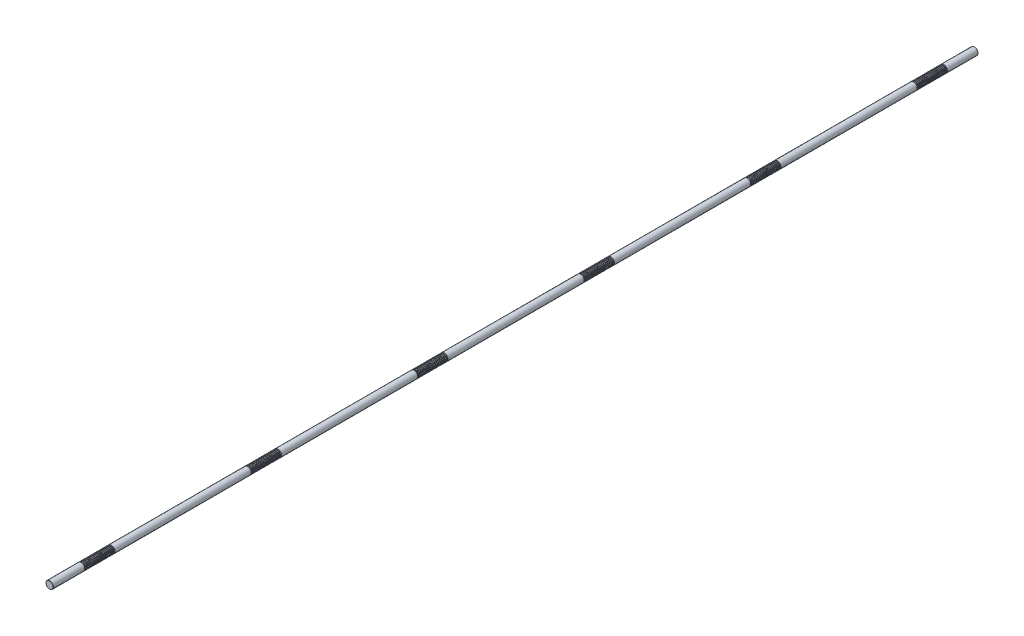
from build123d import *

# Parameters (mm, degrees)
SKETCH1_R           = 12
BOSS_EXTRUDE1_DEPTH = 1500
CHAMFER1_SIZE       = 0.6
LPATTERN1_COUNT     = 20
LPATTERN1_PITCH     = 5
LPATTERN2_COUNT     = 6
LPATTERN2_PITCH     = 540


with BuildPart() as part:
    # Sketch1 → Boss-Extrude1 (new, symmetric)
    with BuildSketch(Plane.XY):
        Circle(SKETCH1_R)
    extrude(amount=BOSS_EXTRUDE1_DEPTH, both=True)

    # Chamfer1
    chamfer1_edges = [part.edges().sort_by_distance(p)[0] for p in [
        (-12, 0, -1500),
        (-12, 0, 1500),
    ]]
    chamfer(chamfer1_edges, length=CHAMFER1_SIZE)

    # Sketch2 → Cut-Revolve1 (revolve, cut)
    with BuildSketch(Plane(origin=(0, 0, 0), x_dir=(0, 0, -1), z_dir=(1, 0, 0)), mode=Mode.PRIVATE) as cut_revolve1_sk:
        Polygon((1400.36843014, 12), (1397.13156986, 12), (1397.86843014, 9.25), (1399.63156986, 9.25), align=None)
    cut_revolve1 = revolve(cut_revolve1_sk.sketch.rotate(Axis((0, 0, 1500), (0, 0, -1)), 90), axis=Axis((0, 0, 1500), (0, 0, -1)), mode=Mode.SUBTRACT)

    # LPattern1: Cut-Revolve1 ×20
    with Locations(*[(0, 0, i * LPATTERN1_PITCH) for i in range(1, LPATTERN1_COUNT)]):
        add(cut_revolve1, mode=Mode.SUBTRACT)

    # LPattern2: Cut-Revolve1 ×6
    with Locations(*[(0, 0, i * LPATTERN2_PITCH) for i in range(1, LPATTERN2_COUNT)]):
        add(cut_revolve1, mode=Mode.SUBTRACT)

    # LPattern2 copy 1 sketch → LPattern2 copy 1 (revolve, cut)
    with BuildSketch(Plane(origin=(0, 0, 545), x_dir=(0, 0, -1), z_dir=(1, 0, 0))):
        Polygon((1400.36843014, 12), (1397.13156986, 12), (1397.86843014, 9.25), (1399.63156986, 9.25), align=None)
    revolve(axis=Axis((0, 0, 2045), (0, 0, -1)), mode=Mode.SUBTRACT)

    # LPattern2 copy 2 sketch → LPattern2 copy 2 (revolve, cut)
    with BuildSketch(Plane(origin=(0, 0, 1085), x_dir=(0, 0, -1), z_dir=(1, 0, 0))):
        Polygon((1400.36843014, 12), (1397.13156986, 12), (1397.86843014, 9.25), (1399.63156986, 9.25), align=None)
    revolve(axis=Axis((0, 0, 2585), (0, 0, -1)), mode=Mode.SUBTRACT)

    # LPattern2 copy 3 sketch → LPattern2 copy 3 (revolve, cut)
    with BuildSketch(Plane(origin=(0, 0, 1625), x_dir=(0, 0, -1), z_dir=(1, 0, 0))):
        Polygon((1400.36843014, 12), (1397.13156986, 12), (1397.86843014, 9.25), (1399.63156986, 9.25), align=None)
    revolve(axis=Axis((0, 0, 3125), (0, 0, -1)), mode=Mode.SUBTRACT)

    # LPattern2 copy 4 sketch → LPattern2 copy 4 (revolve, cut)
    with BuildSketch(Plane(origin=(0, 0, 2165), x_dir=(0, 0, -1), z_dir=(1, 0, 0))):
        Polygon((1400.36843014, 12), (1397.13156986, 12), (1397.86843014, 9.25), (1399.63156986, 9.25), align=None)
    revolve(axis=Axis((0, 0, 3665), (0, 0, -1)), mode=Mode.SUBTRACT)

    # LPattern2 copy 5 sketch → LPattern2 copy 5 (revolve, cut)
    with BuildSketch(Plane(origin=(0, 0, 2705), x_dir=(0, 0, -1), z_dir=(1, 0, 0))):
        Polygon((1400.36843014, 12), (1397.13156986, 12), (1397.86843014, 9.25), (1399.63156986, 9.25), align=None)
    revolve(axis=Axis((0, 0, 4205), (0, 0, -1)), mode=Mode.SUBTRACT)

    # LPattern2 copy 6 sketch → LPattern2 copy 6 (revolve, cut)
    with BuildSketch(Plane(origin=(0, 0, 550), x_dir=(0, 0, -1), z_dir=(1, 0, 0))):
        Polygon((1400.36843014, 12), (1397.13156986, 12), (1397.86843014, 9.25), (1399.63156986, 9.25), align=None)
    revolve(axis=Axis((0, 0, 2050), (0, 0, -1)), mode=Mode.SUBTRACT)

    # LPattern2 copy 7 sketch → LPattern2 copy 7 (revolve, cut)
    with BuildSketch(Plane(origin=(0, 0, 1090), x_dir=(0, 0, -1), z_dir=(1, 0, 0))):
        Polygon((1400.36843014, 12), (1397.13156986, 12), (1397.86843014, 9.25), (1399.63156986, 9.25), align=None)
    revolve(axis=Axis((0, 0, 2590), (0, 0, -1)), mode=Mode.SUBTRACT)

    # LPattern2 copy 8 sketch → LPattern2 copy 8 (revolve, cut)
    with BuildSketch(Plane(origin=(0, 0, 1630), x_dir=(0, 0, -1), z_dir=(1, 0, 0))):
        Polygon((1400.36843014, 12), (1397.13156986, 12), (1397.86843014, 9.25), (1399.63156986, 9.25), align=None)
    revolve(axis=Axis((0, 0, 3130), (0, 0, -1)), mode=Mode.SUBTRACT)

    # LPattern2 copy 9 sketch → LPattern2 copy 9 (revolve, cut)
    with BuildSketch(Plane(origin=(0, 0, 2170), x_dir=(0, 0, -1), z_dir=(1, 0, 0))):
        Polygon((1400.36843014, 12), (1397.13156986, 12), (1397.86843014, 9.25), (1399.63156986, 9.25), align=None)
    revolve(axis=Axis((0, 0, 3670), (0, 0, -1)), mode=Mode.SUBTRACT)

    # LPattern2 copy 10 sketch → LPattern2 copy 10 (revolve, cut)
    with BuildSketch(Plane(origin=(0, 0, 2710), x_dir=(0, 0, -1), z_dir=(1, 0, 0))):
        Polygon((1400.36843014, 12), (1397.13156986, 12), (1397.86843014, 9.25), (1399.63156986, 9.25), align=None)
    revolve(axis=Axis((0, 0, 4210), (0, 0, -1)), mode=Mode.SUBTRACT)

    # LPattern2 copy 11 sketch → LPattern2 copy 11 (revolve, cut)
    with BuildSketch(Plane(origin=(0, 0, 555), x_dir=(0, 0, -1), z_dir=(1, 0, 0))):
        Polygon((1400.36843014, 12), (1397.13156986, 12), (1397.86843014, 9.25), (1399.63156986, 9.25), align=None)
    revolve(axis=Axis((0, 0, 2055), (0, 0, -1)), mode=Mode.SUBTRACT)

    # LPattern2 copy 12 sketch → LPattern2 copy 12 (revolve, cut)
    with BuildSketch(Plane(origin=(0, 0, 1095), x_dir=(0, 0, -1), z_dir=(1, 0, 0))):
        Polygon((1400.36843014, 12), (1397.13156986, 12), (1397.86843014, 9.25), (1399.63156986, 9.25), align=None)
    revolve(axis=Axis((0, 0, 2595), (0, 0, -1)), mode=Mode.SUBTRACT)

    # LPattern2 copy 13 sketch → LPattern2 copy 13 (revolve, cut)
    with BuildSketch(Plane(origin=(0, 0, 1635), x_dir=(0, 0, -1), z_dir=(1, 0, 0))):
        Polygon((1400.36843014, 12), (1397.13156986, 12), (1397.86843014, 9.25), (1399.63156986, 9.25), align=None)
    revolve(axis=Axis((0, 0, 3135), (0, 0, -1)), mode=Mode.SUBTRACT)

    # LPattern2 copy 14 sketch → LPattern2 copy 14 (revolve, cut)
    with BuildSketch(Plane(origin=(0, 0, 2175), x_dir=(0, 0, -1), z_dir=(1, 0, 0))):
        Polygon((1400.36843014, 12), (1397.13156986, 12), (1397.86843014, 9.25), (1399.63156986, 9.25), align=None)
    revolve(axis=Axis((0, 0, 3675), (0, 0, -1)), mode=Mode.SUBTRACT)

    # LPattern2 copy 15 sketch → LPattern2 copy 15 (revolve, cut)
    with BuildSketch(Plane(origin=(0, 0, 2715), x_dir=(0, 0, -1), z_dir=(1, 0, 0))):
        Polygon((1400.36843014, 12), (1397.13156986, 12), (1397.86843014, 9.25), (1399.63156986, 9.25), align=None)
    revolve(axis=Axis((0, 0, 4215), (0, 0, -1)), mode=Mode.SUBTRACT)

    # LPattern2 copy 16 sketch → LPattern2 copy 16 (revolve, cut)
    with BuildSketch(Plane(origin=(0, 0, 560), x_dir=(0, 0, -1), z_dir=(1, 0, 0))):
        Polygon((1400.36843014, 12), (1397.13156986, 12), (1397.86843014, 9.25), (1399.63156986, 9.25), align=None)
    revolve(axis=Axis((0, 0, 2060), (0, 0, -1)), mode=Mode.SUBTRACT)

    # LPattern2 copy 17 sketch → LPattern2 copy 17 (revolve, cut)
    with BuildSketch(Plane(origin=(0, 0, 1100), x_dir=(0, 0, -1), z_dir=(1, 0, 0))):
        Polygon((1400.36843014, 12), (1397.13156986, 12), (1397.86843014, 9.25), (1399.63156986, 9.25), align=None)
    revolve(axis=Axis((0, 0, 2600), (0, 0, -1)), mode=Mode.SUBTRACT)

    # LPattern2 copy 18 sketch → LPattern2 copy 18 (revolve, cut)
    with BuildSketch(Plane(origin=(0, 0, 1640), x_dir=(0, 0, -1), z_dir=(1, 0, 0))):
        Polygon((1400.36843014, 12), (1397.13156986, 12), (1397.86843014, 9.25), (1399.63156986, 9.25), align=None)
    revolve(axis=Axis((0, 0, 3140), (0, 0, -1)), mode=Mode.SUBTRACT)

    # LPattern2 copy 19 sketch → LPattern2 copy 19 (revolve, cut)
    with BuildSketch(Plane(origin=(0, 0, 2180), x_dir=(0, 0, -1), z_dir=(1, 0, 0))):
        Polygon((1400.36843014, 12), (1397.13156986, 12), (1397.86843014, 9.25), (1399.63156986, 9.25), align=None)
    revolve(axis=Axis((0, 0, 3680), (0, 0, -1)), mode=Mode.SUBTRACT)

    # LPattern2 copy 20 sketch → LPattern2 copy 20 (revolve, cut)
    with BuildSketch(Plane(origin=(0, 0, 2720), x_dir=(0, 0, -1), z_dir=(1, 0, 0))):
        Polygon((1400.36843014, 12), (1397.13156986, 12), (1397.86843014, 9.25), (1399.63156986, 9.25), align=None)
    revolve(axis=Axis((0, 0, 4220), (0, 0, -1)), mode=Mode.SUBTRACT)

    # LPattern2 copy 21 sketch → LPattern2 copy 21 (revolve, cut)
    with BuildSketch(Plane(origin=(0, 0, 565), x_dir=(0, 0, -1), z_dir=(1, 0, 0))):
        Polygon((1400.36843014, 12), (1397.13156986, 12), (1397.86843014, 9.25), (1399.63156986, 9.25), align=None)
    revolve(axis=Axis((0, 0, 2065), (0, 0, -1)), mode=Mode.SUBTRACT)

    # LPattern2 copy 22 sketch → LPattern2 copy 22 (revolve, cut)
    with BuildSketch(Plane(origin=(0, 0, 1105), x_dir=(0, 0, -1), z_dir=(1, 0, 0))):
        Polygon((1400.36843014, 12), (1397.13156986, 12), (1397.86843014, 9.25), (1399.63156986, 9.25), align=None)
    revolve(axis=Axis((0, 0, 2605), (0, 0, -1)), mode=Mode.SUBTRACT)

    # LPattern2 copy 23 sketch → LPattern2 copy 23 (revolve, cut)
    with BuildSketch(Plane(origin=(0, 0, 1645), x_dir=(0, 0, -1), z_dir=(1, 0, 0))):
        Polygon((1400.36843014, 12), (1397.13156986, 12), (1397.86843014, 9.25), (1399.63156986, 9.25), align=None)
    revolve(axis=Axis((0, 0, 3145), (0, 0, -1)), mode=Mode.SUBTRACT)

    # LPattern2 copy 24 sketch → LPattern2 copy 24 (revolve, cut)
    with BuildSketch(Plane(origin=(0, 0, 2185), x_dir=(0, 0, -1), z_dir=(1, 0, 0))):
        Polygon((1400.36843014, 12), (1397.13156986, 12), (1397.86843014, 9.25), (1399.63156986, 9.25), align=None)
    revolve(axis=Axis((0, 0, 3685), (0, 0, -1)), mode=Mode.SUBTRACT)

    # LPattern2 copy 25 sketch → LPattern2 copy 25 (revolve, cut)
    with BuildSketch(Plane(origin=(0, 0, 2725), x_dir=(0, 0, -1), z_dir=(1, 0, 0))):
        Polygon((1400.36843014, 12), (1397.13156986, 12), (1397.86843014, 9.25), (1399.63156986, 9.25), align=None)
    revolve(axis=Axis((0, 0, 4225), (0, 0, -1)), mode=Mode.SUBTRACT)

    # LPattern2 copy 26 sketch → LPattern2 copy 26 (revolve, cut)
    with BuildSketch(Plane(origin=(0, 0, 570), x_dir=(0, 0, -1), z_dir=(1, 0, 0))):
        Polygon((1400.36843014, 12), (1397.13156986, 12), (1397.86843014, 9.25), (1399.63156986, 9.25), align=None)
    revolve(axis=Axis((0, 0, 2070), (0, 0, -1)), mode=Mode.SUBTRACT)

    # LPattern2 copy 27 sketch → LPattern2 copy 27 (revolve, cut)
    with BuildSketch(Plane(origin=(0, 0, 1110), x_dir=(0, 0, -1), z_dir=(1, 0, 0))):
        Polygon((1400.36843014, 12), (1397.13156986, 12), (1397.86843014, 9.25), (1399.63156986, 9.25), align=None)
    revolve(axis=Axis((0, 0, 2610), (0, 0, -1)), mode=Mode.SUBTRACT)

    # LPattern2 copy 28 sketch → LPattern2 copy 28 (revolve, cut)
    with BuildSketch(Plane(origin=(0, 0, 1650), x_dir=(0, 0, -1), z_dir=(1, 0, 0))):
        Polygon((1400.36843014, 12), (1397.13156986, 12), (1397.86843014, 9.25), (1399.63156986, 9.25), align=None)
    revolve(axis=Axis((0, 0, 3150), (0, 0, -1)), mode=Mode.SUBTRACT)

    # LPattern2 copy 29 sketch → LPattern2 copy 29 (revolve, cut)
    with BuildSketch(Plane(origin=(0, 0, 2190), x_dir=(0, 0, -1), z_dir=(1, 0, 0))):
        Polygon((1400.36843014, 12), (1397.13156986, 12), (1397.86843014, 9.25), (1399.63156986, 9.25), align=None)
    revolve(axis=Axis((0, 0, 3690), (0, 0, -1)), mode=Mode.SUBTRACT)

    # LPattern2 copy 30 sketch → LPattern2 copy 30 (revolve, cut)
    with BuildSketch(Plane(origin=(0, 0, 2730), x_dir=(0, 0, -1), z_dir=(1, 0, 0))):
        Polygon((1400.36843014, 12), (1397.13156986, 12), (1397.86843014, 9.25), (1399.63156986, 9.25), align=None)
    revolve(axis=Axis((0, 0, 4230), (0, 0, -1)), mode=Mode.SUBTRACT)

    # LPattern2 copy 31 sketch → LPattern2 copy 31 (revolve, cut)
    with BuildSketch(Plane(origin=(0, 0, 575), x_dir=(0, 0, -1), z_dir=(1, 0, 0))):
        Polygon((1400.36843014, 12), (1397.13156986, 12), (1397.86843014, 9.25), (1399.63156986, 9.25), align=None)
    revolve(axis=Axis((0, 0, 2075), (0, 0, -1)), mode=Mode.SUBTRACT)

    # LPattern2 copy 32 sketch → LPattern2 copy 32 (revolve, cut)
    with BuildSketch(Plane(origin=(0, 0, 1115), x_dir=(0, 0, -1), z_dir=(1, 0, 0))):
        Polygon((1400.36843014, 12), (1397.13156986, 12), (1397.86843014, 9.25), (1399.63156986, 9.25), align=None)
    revolve(axis=Axis((0, 0, 2615), (0, 0, -1)), mode=Mode.SUBTRACT)

    # LPattern2 copy 33 sketch → LPattern2 copy 33 (revolve, cut)
    with BuildSketch(Plane(origin=(0, 0, 1655), x_dir=(0, 0, -1), z_dir=(1, 0, 0))):
        Polygon((1400.36843014, 12), (1397.13156986, 12), (1397.86843014, 9.25), (1399.63156986, 9.25), align=None)
    revolve(axis=Axis((0, 0, 3155), (0, 0, -1)), mode=Mode.SUBTRACT)

    # LPattern2 copy 34 sketch → LPattern2 copy 34 (revolve, cut)
    with BuildSketch(Plane(origin=(0, 0, 2195), x_dir=(0, 0, -1), z_dir=(1, 0, 0))):
        Polygon((1400.36843014, 12), (1397.13156986, 12), (1397.86843014, 9.25), (1399.63156986, 9.25), align=None)
    revolve(axis=Axis((0, 0, 3695), (0, 0, -1)), mode=Mode.SUBTRACT)

    # LPattern2 copy 35 sketch → LPattern2 copy 35 (revolve, cut)
    with BuildSketch(Plane(origin=(0, 0, 2735), x_dir=(0, 0, -1), z_dir=(1, 0, 0))):
        Polygon((1400.36843014, 12), (1397.13156986, 12), (1397.86843014, 9.25), (1399.63156986, 9.25), align=None)
    revolve(axis=Axis((0, 0, 4235), (0, 0, -1)), mode=Mode.SUBTRACT)

    # LPattern2 copy 36 sketch → LPattern2 copy 36 (revolve, cut)
    with BuildSketch(Plane(origin=(0, 0, 580), x_dir=(0, 0, -1), z_dir=(1, 0, 0))):
        Polygon((1400.36843014, 12), (1397.13156986, 12), (1397.86843014, 9.25), (1399.63156986, 9.25), align=None)
    revolve(axis=Axis((0, 0, 2080), (0, 0, -1)), mode=Mode.SUBTRACT)

    # LPattern2 copy 37 sketch → LPattern2 copy 37 (revolve, cut)
    with BuildSketch(Plane(origin=(0, 0, 1120), x_dir=(0, 0, -1), z_dir=(1, 0, 0))):
        Polygon((1400.36843014, 12), (1397.13156986, 12), (1397.86843014, 9.25), (1399.63156986, 9.25), align=None)
    revolve(axis=Axis((0, 0, 2620), (0, 0, -1)), mode=Mode.SUBTRACT)

    # LPattern2 copy 38 sketch → LPattern2 copy 38 (revolve, cut)
    with BuildSketch(Plane(origin=(0, 0, 1660), x_dir=(0, 0, -1), z_dir=(1, 0, 0))):
        Polygon((1400.36843014, 12), (1397.13156986, 12), (1397.86843014, 9.25), (1399.63156986, 9.25), align=None)
    revolve(axis=Axis((0, 0, 3160), (0, 0, -1)), mode=Mode.SUBTRACT)

    # LPattern2 copy 39 sketch → LPattern2 copy 39 (revolve, cut)
    with BuildSketch(Plane(origin=(0, 0, 2200), x_dir=(0, 0, -1), z_dir=(1, 0, 0))):
        Polygon((1400.36843014, 12), (1397.13156986, 12), (1397.86843014, 9.25), (1399.63156986, 9.25), align=None)
    revolve(axis=Axis((0, 0, 3700), (0, 0, -1)), mode=Mode.SUBTRACT)

    # LPattern2 copy 40 sketch → LPattern2 copy 40 (revolve, cut)
    with BuildSketch(Plane(origin=(0, 0, 2740), x_dir=(0, 0, -1), z_dir=(1, 0, 0))):
        Polygon((1400.36843014, 12), (1397.13156986, 12), (1397.86843014, 9.25), (1399.63156986, 9.25), align=None)
    revolve(axis=Axis((0, 0, 4240), (0, 0, -1)), mode=Mode.SUBTRACT)

    # LPattern2 copy 41 sketch → LPattern2 copy 41 (revolve, cut)
    with BuildSketch(Plane(origin=(0, 0, 585), x_dir=(0, 0, -1), z_dir=(1, 0, 0))):
        Polygon((1400.36843014, 12), (1397.13156986, 12), (1397.86843014, 9.25), (1399.63156986, 9.25), align=None)
    revolve(axis=Axis((0, 0, 2085), (0, 0, -1)), mode=Mode.SUBTRACT)

    # LPattern2 copy 42 sketch → LPattern2 copy 42 (revolve, cut)
    with BuildSketch(Plane(origin=(0, 0, 1125), x_dir=(0, 0, -1), z_dir=(1, 0, 0))):
        Polygon((1400.36843014, 12), (1397.13156986, 12), (1397.86843014, 9.25), (1399.63156986, 9.25), align=None)
    revolve(axis=Axis((0, 0, 2625), (0, 0, -1)), mode=Mode.SUBTRACT)

    # LPattern2 copy 43 sketch → LPattern2 copy 43 (revolve, cut)
    with BuildSketch(Plane(origin=(0, 0, 1665), x_dir=(0, 0, -1), z_dir=(1, 0, 0))):
        Polygon((1400.36843014, 12), (1397.13156986, 12), (1397.86843014, 9.25), (1399.63156986, 9.25), align=None)
    revolve(axis=Axis((0, 0, 3165), (0, 0, -1)), mode=Mode.SUBTRACT)

    # LPattern2 copy 44 sketch → LPattern2 copy 44 (revolve, cut)
    with BuildSketch(Plane(origin=(0, 0, 2205), x_dir=(0, 0, -1), z_dir=(1, 0, 0))):
        Polygon((1400.36843014, 12), (1397.13156986, 12), (1397.86843014, 9.25), (1399.63156986, 9.25), align=None)
    revolve(axis=Axis((0, 0, 3705), (0, 0, -1)), mode=Mode.SUBTRACT)

    # LPattern2 copy 45 sketch → LPattern2 copy 45 (revolve, cut)
    with BuildSketch(Plane(origin=(0, 0, 2745), x_dir=(0, 0, -1), z_dir=(1, 0, 0))):
        Polygon((1400.36843014, 12), (1397.13156986, 12), (1397.86843014, 9.25), (1399.63156986, 9.25), align=None)
    revolve(axis=Axis((0, 0, 4245), (0, 0, -1)), mode=Mode.SUBTRACT)

    # LPattern2 copy 46 sketch → LPattern2 copy 46 (revolve, cut)
    with BuildSketch(Plane(origin=(0, 0, 590), x_dir=(0, 0, -1), z_dir=(1, 0, 0))):
        Polygon((1400.36843014, 12), (1397.13156986, 12), (1397.86843014, 9.25), (1399.63156986, 9.25), align=None)
    revolve(axis=Axis((0, 0, 2090), (0, 0, -1)), mode=Mode.SUBTRACT)

    # LPattern2 copy 47 sketch → LPattern2 copy 47 (revolve, cut)
    with BuildSketch(Plane(origin=(0, 0, 1130), x_dir=(0, 0, -1), z_dir=(1, 0, 0))):
        Polygon((1400.36843014, 12), (1397.13156986, 12), (1397.86843014, 9.25), (1399.63156986, 9.25), align=None)
    revolve(axis=Axis((0, 0, 2630), (0, 0, -1)), mode=Mode.SUBTRACT)

    # LPattern2 copy 48 sketch → LPattern2 copy 48 (revolve, cut)
    with BuildSketch(Plane(origin=(0, 0, 1670), x_dir=(0, 0, -1), z_dir=(1, 0, 0))):
        Polygon((1400.36843014, 12), (1397.13156986, 12), (1397.86843014, 9.25), (1399.63156986, 9.25), align=None)
    revolve(axis=Axis((0, 0, 3170), (0, 0, -1)), mode=Mode.SUBTRACT)

    # LPattern2 copy 49 sketch → LPattern2 copy 49 (revolve, cut)
    with BuildSketch(Plane(origin=(0, 0, 2210), x_dir=(0, 0, -1), z_dir=(1, 0, 0))):
        Polygon((1400.36843014, 12), (1397.13156986, 12), (1397.86843014, 9.25), (1399.63156986, 9.25), align=None)
    revolve(axis=Axis((0, 0, 3710), (0, 0, -1)), mode=Mode.SUBTRACT)

    # LPattern2 copy 50 sketch → LPattern2 copy 50 (revolve, cut)
    with BuildSketch(Plane(origin=(0, 0, 2750), x_dir=(0, 0, -1), z_dir=(1, 0, 0))):
        Polygon((1400.36843014, 12), (1397.13156986, 12), (1397.86843014, 9.25), (1399.63156986, 9.25), align=None)
    revolve(axis=Axis((0, 0, 4250), (0, 0, -1)), mode=Mode.SUBTRACT)

    # LPattern2 copy 51 sketch → LPattern2 copy 51 (revolve, cut)
    with BuildSketch(Plane(origin=(0, 0, 595), x_dir=(0, 0, -1), z_dir=(1, 0, 0))):
        Polygon((1400.36843014, 12), (1397.13156986, 12), (1397.86843014, 9.25), (1399.63156986, 9.25), align=None)
    revolve(axis=Axis((0, 0, 2095), (0, 0, -1)), mode=Mode.SUBTRACT)

    # LPattern2 copy 52 sketch → LPattern2 copy 52 (revolve, cut)
    with BuildSketch(Plane(origin=(0, 0, 1135), x_dir=(0, 0, -1), z_dir=(1, 0, 0))):
        Polygon((1400.36843014, 12), (1397.13156986, 12), (1397.86843014, 9.25), (1399.63156986, 9.25), align=None)
    revolve(axis=Axis((0, 0, 2635), (0, 0, -1)), mode=Mode.SUBTRACT)

    # LPattern2 copy 53 sketch → LPattern2 copy 53 (revolve, cut)
    with BuildSketch(Plane(origin=(0, 0, 1675), x_dir=(0, 0, -1), z_dir=(1, 0, 0))):
        Polygon((1400.36843014, 12), (1397.13156986, 12), (1397.86843014, 9.25), (1399.63156986, 9.25), align=None)
    revolve(axis=Axis((0, 0, 3175), (0, 0, -1)), mode=Mode.SUBTRACT)

    # LPattern2 copy 54 sketch → LPattern2 copy 54 (revolve, cut)
    with BuildSketch(Plane(origin=(0, 0, 2215), x_dir=(0, 0, -1), z_dir=(1, 0, 0))):
        Polygon((1400.36843014, 12), (1397.13156986, 12), (1397.86843014, 9.25), (1399.63156986, 9.25), align=None)
    revolve(axis=Axis((0, 0, 3715), (0, 0, -1)), mode=Mode.SUBTRACT)

    # LPattern2 copy 55 sketch → LPattern2 copy 55 (revolve, cut)
    with BuildSketch(Plane(origin=(0, 0, 2755), x_dir=(0, 0, -1), z_dir=(1, 0, 0))):
        Polygon((1400.36843014, 12), (1397.13156986, 12), (1397.86843014, 9.25), (1399.63156986, 9.25), align=None)
    revolve(axis=Axis((0, 0, 4255), (0, 0, -1)), mode=Mode.SUBTRACT)

    # LPattern2 copy 56 sketch → LPattern2 copy 56 (revolve, cut)
    with BuildSketch(Plane(origin=(0, 0, 600), x_dir=(0, 0, -1), z_dir=(1, 0, 0))):
        Polygon((1400.36843014, 12), (1397.13156986, 12), (1397.86843014, 9.25), (1399.63156986, 9.25), align=None)
    revolve(axis=Axis((0, 0, 2100), (0, 0, -1)), mode=Mode.SUBTRACT)

    # LPattern2 copy 57 sketch → LPattern2 copy 57 (revolve, cut)
    with BuildSketch(Plane(origin=(0, 0, 1140), x_dir=(0, 0, -1), z_dir=(1, 0, 0))):
        Polygon((1400.36843014, 12), (1397.13156986, 12), (1397.86843014, 9.25), (1399.63156986, 9.25), align=None)
    revolve(axis=Axis((0, 0, 2640), (0, 0, -1)), mode=Mode.SUBTRACT)

    # LPattern2 copy 58 sketch → LPattern2 copy 58 (revolve, cut)
    with BuildSketch(Plane(origin=(0, 0, 1680), x_dir=(0, 0, -1), z_dir=(1, 0, 0))):
        Polygon((1400.36843014, 12), (1397.13156986, 12), (1397.86843014, 9.25), (1399.63156986, 9.25), align=None)
    revolve(axis=Axis((0, 0, 3180), (0, 0, -1)), mode=Mode.SUBTRACT)

    # LPattern2 copy 59 sketch → LPattern2 copy 59 (revolve, cut)
    with BuildSketch(Plane(origin=(0, 0, 2220), x_dir=(0, 0, -1), z_dir=(1, 0, 0))):
        Polygon((1400.36843014, 12), (1397.13156986, 12), (1397.86843014, 9.25), (1399.63156986, 9.25), align=None)
    revolve(axis=Axis((0, 0, 3720), (0, 0, -1)), mode=Mode.SUBTRACT)

    # LPattern2 copy 60 sketch → LPattern2 copy 60 (revolve, cut)
    with BuildSketch(Plane(origin=(0, 0, 2760), x_dir=(0, 0, -1), z_dir=(1, 0, 0))):
        Polygon((1400.36843014, 12), (1397.13156986, 12), (1397.86843014, 9.25), (1399.63156986, 9.25), align=None)
    revolve(axis=Axis((0, 0, 4260), (0, 0, -1)), mode=Mode.SUBTRACT)

    # LPattern2 copy 61 sketch → LPattern2 copy 61 (revolve, cut)
    with BuildSketch(Plane(origin=(0, 0, 605), x_dir=(0, 0, -1), z_dir=(1, 0, 0))):
        Polygon((1400.36843014, 12), (1397.13156986, 12), (1397.86843014, 9.25), (1399.63156986, 9.25), align=None)
    revolve(axis=Axis((0, 0, 2105), (0, 0, -1)), mode=Mode.SUBTRACT)

    # LPattern2 copy 62 sketch → LPattern2 copy 62 (revolve, cut)
    with BuildSketch(Plane(origin=(0, 0, 1145), x_dir=(0, 0, -1), z_dir=(1, 0, 0))):
        Polygon((1400.36843014, 12), (1397.13156986, 12), (1397.86843014, 9.25), (1399.63156986, 9.25), align=None)
    revolve(axis=Axis((0, 0, 2645), (0, 0, -1)), mode=Mode.SUBTRACT)

    # LPattern2 copy 63 sketch → LPattern2 copy 63 (revolve, cut)
    with BuildSketch(Plane(origin=(0, 0, 1685), x_dir=(0, 0, -1), z_dir=(1, 0, 0))):
        Polygon((1400.36843014, 12), (1397.13156986, 12), (1397.86843014, 9.25), (1399.63156986, 9.25), align=None)
    revolve(axis=Axis((0, 0, 3185), (0, 0, -1)), mode=Mode.SUBTRACT)

    # LPattern2 copy 64 sketch → LPattern2 copy 64 (revolve, cut)
    with BuildSketch(Plane(origin=(0, 0, 2225), x_dir=(0, 0, -1), z_dir=(1, 0, 0))):
        Polygon((1400.36843014, 12), (1397.13156986, 12), (1397.86843014, 9.25), (1399.63156986, 9.25), align=None)
    revolve(axis=Axis((0, 0, 3725), (0, 0, -1)), mode=Mode.SUBTRACT)

    # LPattern2 copy 65 sketch → LPattern2 copy 65 (revolve, cut)
    with BuildSketch(Plane(origin=(0, 0, 2765), x_dir=(0, 0, -1), z_dir=(1, 0, 0))):
        Polygon((1400.36843014, 12), (1397.13156986, 12), (1397.86843014, 9.25), (1399.63156986, 9.25), align=None)
    revolve(axis=Axis((0, 0, 4265), (0, 0, -1)), mode=Mode.SUBTRACT)

    # LPattern2 copy 66 sketch → LPattern2 copy 66 (revolve, cut)
    with BuildSketch(Plane(origin=(0, 0, 610), x_dir=(0, 0, -1), z_dir=(1, 0, 0))):
        Polygon((1400.36843014, 12), (1397.13156986, 12), (1397.86843014, 9.25), (1399.63156986, 9.25), align=None)
    revolve(axis=Axis((0, 0, 2110), (0, 0, -1)), mode=Mode.SUBTRACT)

    # LPattern2 copy 67 sketch → LPattern2 copy 67 (revolve, cut)
    with BuildSketch(Plane(origin=(0, 0, 1150), x_dir=(0, 0, -1), z_dir=(1, 0, 0))):
        Polygon((1400.36843014, 12), (1397.13156986, 12), (1397.86843014, 9.25), (1399.63156986, 9.25), align=None)
    revolve(axis=Axis((0, 0, 2650), (0, 0, -1)), mode=Mode.SUBTRACT)

    # LPattern2 copy 68 sketch → LPattern2 copy 68 (revolve, cut)
    with BuildSketch(Plane(origin=(0, 0, 1690), x_dir=(0, 0, -1), z_dir=(1, 0, 0))):
        Polygon((1400.36843014, 12), (1397.13156986, 12), (1397.86843014, 9.25), (1399.63156986, 9.25), align=None)
    revolve(axis=Axis((0, 0, 3190), (0, 0, -1)), mode=Mode.SUBTRACT)

    # LPattern2 copy 69 sketch → LPattern2 copy 69 (revolve, cut)
    with BuildSketch(Plane(origin=(0, 0, 2230), x_dir=(0, 0, -1), z_dir=(1, 0, 0))):
        Polygon((1400.36843014, 12), (1397.13156986, 12), (1397.86843014, 9.25), (1399.63156986, 9.25), align=None)
    revolve(axis=Axis((0, 0, 3730), (0, 0, -1)), mode=Mode.SUBTRACT)

    # LPattern2 copy 70 sketch → LPattern2 copy 70 (revolve, cut)
    with BuildSketch(Plane(origin=(0, 0, 2770), x_dir=(0, 0, -1), z_dir=(1, 0, 0))):
        Polygon((1400.36843014, 12), (1397.13156986, 12), (1397.86843014, 9.25), (1399.63156986, 9.25), align=None)
    revolve(axis=Axis((0, 0, 4270), (0, 0, -1)), mode=Mode.SUBTRACT)

    # LPattern2 copy 71 sketch → LPattern2 copy 71 (revolve, cut)
    with BuildSketch(Plane(origin=(0, 0, 615), x_dir=(0, 0, -1), z_dir=(1, 0, 0))):
        Polygon((1400.36843014, 12), (1397.13156986, 12), (1397.86843014, 9.25), (1399.63156986, 9.25), align=None)
    revolve(axis=Axis((0, 0, 2115), (0, 0, -1)), mode=Mode.SUBTRACT)

    # LPattern2 copy 72 sketch → LPattern2 copy 72 (revolve, cut)
    with BuildSketch(Plane(origin=(0, 0, 1155), x_dir=(0, 0, -1), z_dir=(1, 0, 0))):
        Polygon((1400.36843014, 12), (1397.13156986, 12), (1397.86843014, 9.25), (1399.63156986, 9.25), align=None)
    revolve(axis=Axis((0, 0, 2655), (0, 0, -1)), mode=Mode.SUBTRACT)

    # LPattern2 copy 73 sketch → LPattern2 copy 73 (revolve, cut)
    with BuildSketch(Plane(origin=(0, 0, 1695), x_dir=(0, 0, -1), z_dir=(1, 0, 0))):
        Polygon((1400.36843014, 12), (1397.13156986, 12), (1397.86843014, 9.25), (1399.63156986, 9.25), align=None)
    revolve(axis=Axis((0, 0, 3195), (0, 0, -1)), mode=Mode.SUBTRACT)

    # LPattern2 copy 74 sketch → LPattern2 copy 74 (revolve, cut)
    with BuildSketch(Plane(origin=(0, 0, 2235), x_dir=(0, 0, -1), z_dir=(1, 0, 0))):
        Polygon((1400.36843014, 12), (1397.13156986, 12), (1397.86843014, 9.25), (1399.63156986, 9.25), align=None)
    revolve(axis=Axis((0, 0, 3735), (0, 0, -1)), mode=Mode.SUBTRACT)

    # LPattern2 copy 75 sketch → LPattern2 copy 75 (revolve, cut)
    with BuildSketch(Plane(origin=(0, 0, 2775), x_dir=(0, 0, -1), z_dir=(1, 0, 0))):
        Polygon((1400.36843014, 12), (1397.13156986, 12), (1397.86843014, 9.25), (1399.63156986, 9.25), align=None)
    revolve(axis=Axis((0, 0, 4275), (0, 0, -1)), mode=Mode.SUBTRACT)

    # LPattern2 copy 76 sketch → LPattern2 copy 76 (revolve, cut)
    with BuildSketch(Plane(origin=(0, 0, 620), x_dir=(0, 0, -1), z_dir=(1, 0, 0))):
        Polygon((1400.36843014, 12), (1397.13156986, 12), (1397.86843014, 9.25), (1399.63156986, 9.25), align=None)
    revolve(axis=Axis((0, 0, 2120), (0, 0, -1)), mode=Mode.SUBTRACT)

    # LPattern2 copy 77 sketch → LPattern2 copy 77 (revolve, cut)
    with BuildSketch(Plane(origin=(0, 0, 1160), x_dir=(0, 0, -1), z_dir=(1, 0, 0))):
        Polygon((1400.36843014, 12), (1397.13156986, 12), (1397.86843014, 9.25), (1399.63156986, 9.25), align=None)
    revolve(axis=Axis((0, 0, 2660), (0, 0, -1)), mode=Mode.SUBTRACT)

    # LPattern2 copy 78 sketch → LPattern2 copy 78 (revolve, cut)
    with BuildSketch(Plane(origin=(0, 0, 1700), x_dir=(0, 0, -1), z_dir=(1, 0, 0))):
        Polygon((1400.36843014, 12), (1397.13156986, 12), (1397.86843014, 9.25), (1399.63156986, 9.25), align=None)
    revolve(axis=Axis((0, 0, 3200), (0, 0, -1)), mode=Mode.SUBTRACT)

    # LPattern2 copy 79 sketch → LPattern2 copy 79 (revolve, cut)
    with BuildSketch(Plane(origin=(0, 0, 2240), x_dir=(0, 0, -1), z_dir=(1, 0, 0))):
        Polygon((1400.36843014, 12), (1397.13156986, 12), (1397.86843014, 9.25), (1399.63156986, 9.25), align=None)
    revolve(axis=Axis((0, 0, 3740), (0, 0, -1)), mode=Mode.SUBTRACT)

    # LPattern2 copy 80 sketch → LPattern2 copy 80 (revolve, cut)
    with BuildSketch(Plane(origin=(0, 0, 2780), x_dir=(0, 0, -1), z_dir=(1, 0, 0))):
        Polygon((1400.36843014, 12), (1397.13156986, 12), (1397.86843014, 9.25), (1399.63156986, 9.25), align=None)
    revolve(axis=Axis((0, 0, 4280), (0, 0, -1)), mode=Mode.SUBTRACT)

    # LPattern2 copy 81 sketch → LPattern2 copy 81 (revolve, cut)
    with BuildSketch(Plane(origin=(0, 0, 625), x_dir=(0, 0, -1), z_dir=(1, 0, 0))):
        Polygon((1400.36843014, 12), (1397.13156986, 12), (1397.86843014, 9.25), (1399.63156986, 9.25), align=None)
    revolve(axis=Axis((0, 0, 2125), (0, 0, -1)), mode=Mode.SUBTRACT)

    # LPattern2 copy 82 sketch → LPattern2 copy 82 (revolve, cut)
    with BuildSketch(Plane(origin=(0, 0, 1165), x_dir=(0, 0, -1), z_dir=(1, 0, 0))):
        Polygon((1400.36843014, 12), (1397.13156986, 12), (1397.86843014, 9.25), (1399.63156986, 9.25), align=None)
    revolve(axis=Axis((0, 0, 2665), (0, 0, -1)), mode=Mode.SUBTRACT)

    # LPattern2 copy 83 sketch → LPattern2 copy 83 (revolve, cut)
    with BuildSketch(Plane(origin=(0, 0, 1705), x_dir=(0, 0, -1), z_dir=(1, 0, 0))):
        Polygon((1400.36843014, 12), (1397.13156986, 12), (1397.86843014, 9.25), (1399.63156986, 9.25), align=None)
    revolve(axis=Axis((0, 0, 3205), (0, 0, -1)), mode=Mode.SUBTRACT)

    # LPattern2 copy 84 sketch → LPattern2 copy 84 (revolve, cut)
    with BuildSketch(Plane(origin=(0, 0, 2245), x_dir=(0, 0, -1), z_dir=(1, 0, 0))):
        Polygon((1400.36843014, 12), (1397.13156986, 12), (1397.86843014, 9.25), (1399.63156986, 9.25), align=None)
    revolve(axis=Axis((0, 0, 3745), (0, 0, -1)), mode=Mode.SUBTRACT)

    # LPattern2 copy 85 sketch → LPattern2 copy 85 (revolve, cut)
    with BuildSketch(Plane(origin=(0, 0, 2785), x_dir=(0, 0, -1), z_dir=(1, 0, 0))):
        Polygon((1400.36843014, 12), (1397.13156986, 12), (1397.86843014, 9.25), (1399.63156986, 9.25), align=None)
    revolve(axis=Axis((0, 0, 4285), (0, 0, -1)), mode=Mode.SUBTRACT)

    # LPattern2 copy 86 sketch → LPattern2 copy 86 (revolve, cut)
    with BuildSketch(Plane(origin=(0, 0, 630), x_dir=(0, 0, -1), z_dir=(1, 0, 0))):
        Polygon((1400.36843014, 12), (1397.13156986, 12), (1397.86843014, 9.25), (1399.63156986, 9.25), align=None)
    revolve(axis=Axis((0, 0, 2130), (0, 0, -1)), mode=Mode.SUBTRACT)

    # LPattern2 copy 87 sketch → LPattern2 copy 87 (revolve, cut)
    with BuildSketch(Plane(origin=(0, 0, 1170), x_dir=(0, 0, -1), z_dir=(1, 0, 0))):
        Polygon((1400.36843014, 12), (1397.13156986, 12), (1397.86843014, 9.25), (1399.63156986, 9.25), align=None)
    revolve(axis=Axis((0, 0, 2670), (0, 0, -1)), mode=Mode.SUBTRACT)

    # LPattern2 copy 88 sketch → LPattern2 copy 88 (revolve, cut)
    with BuildSketch(Plane(origin=(0, 0, 1710), x_dir=(0, 0, -1), z_dir=(1, 0, 0))):
        Polygon((1400.36843014, 12), (1397.13156986, 12), (1397.86843014, 9.25), (1399.63156986, 9.25), align=None)
    revolve(axis=Axis((0, 0, 3210), (0, 0, -1)), mode=Mode.SUBTRACT)

    # LPattern2 copy 89 sketch → LPattern2 copy 89 (revolve, cut)
    with BuildSketch(Plane(origin=(0, 0, 2250), x_dir=(0, 0, -1), z_dir=(1, 0, 0))):
        Polygon((1400.36843014, 12), (1397.13156986, 12), (1397.86843014, 9.25), (1399.63156986, 9.25), align=None)
    revolve(axis=Axis((0, 0, 3750), (0, 0, -1)), mode=Mode.SUBTRACT)

    # LPattern2 copy 90 sketch → LPattern2 copy 90 (revolve, cut)
    with BuildSketch(Plane(origin=(0, 0, 2790), x_dir=(0, 0, -1), z_dir=(1, 0, 0))):
        Polygon((1400.36843014, 12), (1397.13156986, 12), (1397.86843014, 9.25), (1399.63156986, 9.25), align=None)
    revolve(axis=Axis((0, 0, 4290), (0, 0, -1)), mode=Mode.SUBTRACT)

    # LPattern2 copy 91 sketch → LPattern2 copy 91 (revolve, cut)
    with BuildSketch(Plane(origin=(0, 0, 635), x_dir=(0, 0, -1), z_dir=(1, 0, 0))):
        Polygon((1400.36843014, 12), (1397.13156986, 12), (1397.86843014, 9.25), (1399.63156986, 9.25), align=None)
    revolve(axis=Axis((0, 0, 2135), (0, 0, -1)), mode=Mode.SUBTRACT)

    # LPattern2 copy 92 sketch → LPattern2 copy 92 (revolve, cut)
    with BuildSketch(Plane(origin=(0, 0, 1175), x_dir=(0, 0, -1), z_dir=(1, 0, 0))):
        Polygon((1400.36843014, 12), (1397.13156986, 12), (1397.86843014, 9.25), (1399.63156986, 9.25), align=None)
    revolve(axis=Axis((0, 0, 2675), (0, 0, -1)), mode=Mode.SUBTRACT)

    # LPattern2 copy 93 sketch → LPattern2 copy 93 (revolve, cut)
    with BuildSketch(Plane(origin=(0, 0, 1715), x_dir=(0, 0, -1), z_dir=(1, 0, 0))):
        Polygon((1400.36843014, 12), (1397.13156986, 12), (1397.86843014, 9.25), (1399.63156986, 9.25), align=None)
    revolve(axis=Axis((0, 0, 3215), (0, 0, -1)), mode=Mode.SUBTRACT)

    # LPattern2 copy 94 sketch → LPattern2 copy 94 (revolve, cut)
    with BuildSketch(Plane(origin=(0, 0, 2255), x_dir=(0, 0, -1), z_dir=(1, 0, 0))):
        Polygon((1400.36843014, 12), (1397.13156986, 12), (1397.86843014, 9.25), (1399.63156986, 9.25), align=None)
    revolve(axis=Axis((0, 0, 3755), (0, 0, -1)), mode=Mode.SUBTRACT)

    # LPattern2 copy 95 sketch → LPattern2 copy 95 (revolve, cut)
    with BuildSketch(Plane(origin=(0, 0, 2795), x_dir=(0, 0, -1), z_dir=(1, 0, 0))):
        Polygon((1400.36843014, 12), (1397.13156986, 12), (1397.86843014, 9.25), (1399.63156986, 9.25), align=None)
    revolve(axis=Axis((0, 0, 4295), (0, 0, -1)), mode=Mode.SUBTRACT)


solid = part.part
